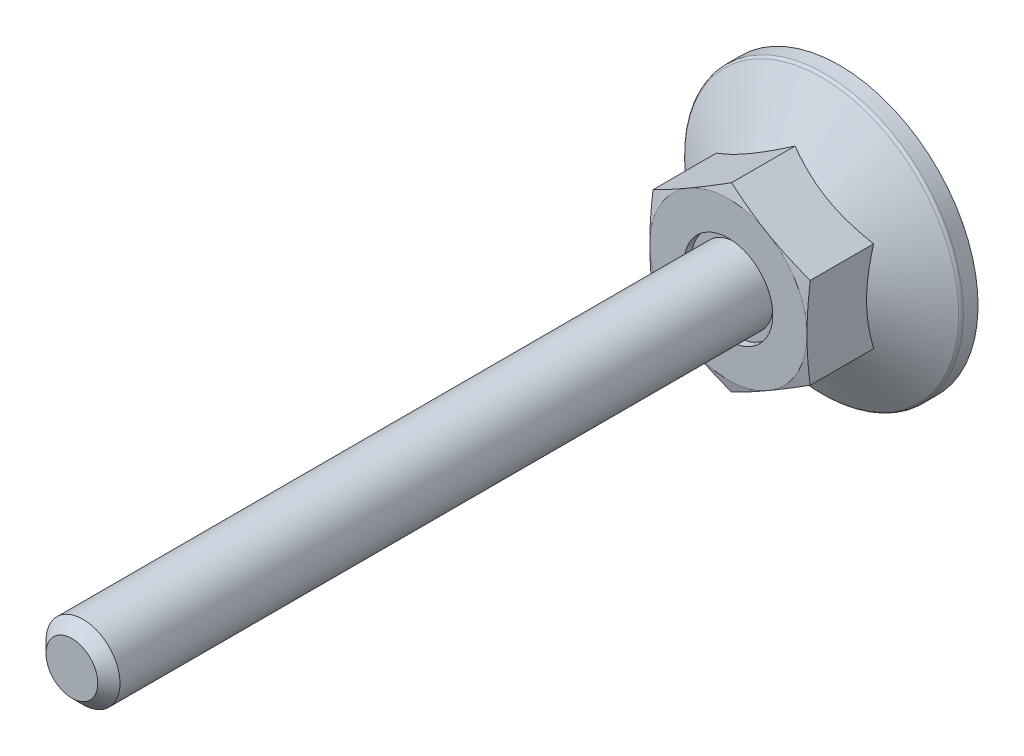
ISO-10303-21;
HEADER;
FILE_DESCRIPTION(('STEP AP214'),'2;1');
FILE_NAME('part.step','',(''),(''),'','','');
FILE_SCHEMA(('AUTOMOTIVE_DESIGN { 1 0 10303 214 1 1 1 1 }'));
ENDSEC;
DATA;
#1=APPLICATION_CONTEXT('core data for automotive mechanical design processes');
#2=APPLICATION_PROTOCOL_DEFINITION('international standard','automotive_design',2000,#1);
#3=PRODUCT_CONTEXT('',#1,'mechanical');
#4=PRODUCT('Part','Part','',(#3));
#5=PRODUCT_RELATED_PRODUCT_CATEGORY('part','',(#4));
#6=PRODUCT_DEFINITION_FORMATION('','',#4);
#7=PRODUCT_DEFINITION_CONTEXT('part definition',#1,'design');
#8=PRODUCT_DEFINITION('design','',#6,#7);
#9=PRODUCT_DEFINITION_SHAPE('','',#8);
#10=(LENGTH_UNIT() NAMED_UNIT(*) SI_UNIT(.MILLI.,.METRE.));
#11=(NAMED_UNIT(*) PLANE_ANGLE_UNIT() SI_UNIT($,.RADIAN.));
#12=(NAMED_UNIT(*) SI_UNIT($,.STERADIAN.) SOLID_ANGLE_UNIT());
#13=UNCERTAINTY_MEASURE_WITH_UNIT(LENGTH_MEASURE(1.E-05),#10,'distance_accuracy_value','');
#14=(GEOMETRIC_REPRESENTATION_CONTEXT(3) GLOBAL_UNCERTAINTY_ASSIGNED_CONTEXT((#13)) GLOBAL_UNIT_ASSIGNED_CONTEXT((#10,
#11,#12)) REPRESENTATION_CONTEXT('',''));
#15=CARTESIAN_POINT('',(0.,0.,0.));
#16=DIRECTION('',(0.,0.,1.));
#17=DIRECTION('',(1.,0.,0.));
#18=AXIS2_PLACEMENT_3D('',#15,#16,#17);
#19=CARTESIAN_POINT('',(0.,0.,11.2));
#20=DIRECTION('',(0.,0.,-1.));
#21=DIRECTION('',(0.,1.,0.));
#22=AXIS2_PLACEMENT_3D('',#19,#20,#21);
#23=PLANE('',#22);
#24=CARTESIAN_POINT('',(0.,0.,11.2));
#25=DIRECTION('',(0.,0.,-1.));
#26=DIRECTION('',(0.,1.,0.));
#27=AXIS2_PLACEMENT_3D('',#24,#25,#26);
#28=CIRCLE('',#27,4.8);
#29=CARTESIAN_POINT('',(0.,4.8,11.2));
#30=VERTEX_POINT('',#29);
#31=EDGE_CURVE('E108',#30,#30,#28,.T.);
#32=ORIENTED_EDGE('',*,*,#31,.F.);
#33=EDGE_LOOP('',(#32));
#34=FACE_BOUND('',#33,.T.);
#35=CARTESIAN_POINT('',(0.,0.,11.2));
#36=DIRECTION('',(0.,0.,-1.));
#37=DIRECTION('',(0.,1.,0.));
#38=AXIS2_PLACEMENT_3D('',#35,#36,#37);
#39=CIRCLE('',#38,4.);
#40=CARTESIAN_POINT('',(0.,4.,11.2));
#41=VERTEX_POINT('',#40);
#42=EDGE_CURVE('E259',#41,#41,#39,.F.);
#43=ORIENTED_EDGE('',*,*,#42,.F.);
#44=EDGE_LOOP('',(#43));
#45=FACE_BOUND('',#44,.T.);
#46=ADVANCED_FACE('F14',(#34,#45),#23,.F.);
#47=CARTESIAN_POINT('',(0.,9.81495457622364,32.));
#48=DIRECTION('',(0.5,-0.866025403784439,0.));
#49=DIRECTION('',(0.866025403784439,0.5,0.));
#50=AXIS2_PLACEMENT_3D('',#47,#48,#49);
#51=PLANE('',#50);
#52=CARTESIAN_POINT('',(-8.5002,4.90736181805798,4.7935207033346));
#53=CARTESIAN_POINT('',(-8.31336077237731,5.01523349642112,4.85579061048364));
#54=CARTESIAN_POINT('',(-8.1258249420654,5.1235073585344,4.91523445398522));
#55=CARTESIAN_POINT('',(-7.74923024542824,5.34093440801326,5.02769163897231));
#56=CARTESIAN_POINT('',(-7.56017075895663,5.45008795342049,5.08070220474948));
#57=CARTESIAN_POINT('',(-6.9899652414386,5.77929626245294,5.22904336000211));
#58=CARTESIAN_POINT('',(-6.60656835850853,6.00065055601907,5.31341782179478));
#59=CARTESIAN_POINT('',(-6.03282233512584,6.33190297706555,5.41235673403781));
#60=CARTESIAN_POINT('',(-5.84418723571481,6.44081150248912,5.44054155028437));
#61=CARTESIAN_POINT('',(-5.46606397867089,6.65912106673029,5.48780266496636));
#62=CARTESIAN_POINT('',(-5.27657589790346,6.76852206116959,5.5068797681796));
#63=CARTESIAN_POINT('',(-4.8972734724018,6.98751241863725,5.53544197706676));
#64=CARTESIAN_POINT('',(-4.70745974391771,7.09710142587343,5.54493796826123));
#65=CARTESIAN_POINT('',(-4.32765694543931,7.3163806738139,5.55413437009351));
#66=CARTESIAN_POINT('',(-4.13766788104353,7.42607091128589,5.55383508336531));
#67=CARTESIAN_POINT('',(-3.78247698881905,7.63114046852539,5.54412227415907));
#68=CARTESIAN_POINT('',(-3.6172500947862,7.72653426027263,5.53589358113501));
#69=CARTESIAN_POINT('',(-3.28718328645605,7.9170984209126,5.51218750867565));
#70=CARTESIAN_POINT('',(-3.12234339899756,8.01226877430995,5.49670964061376));
#71=CARTESIAN_POINT('',(-2.62846189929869,8.29741139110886,5.43976812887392));
#72=CARTESIAN_POINT('',(-2.30029449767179,8.48687892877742,5.38780368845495));
#73=CARTESIAN_POINT('',(-1.64047857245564,8.86782383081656,5.25789180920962));
#74=CARTESIAN_POINT('',(-1.30891425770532,9.05925257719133,5.17939367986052));
#75=CARTESIAN_POINT('',(-0.650730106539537,9.43925537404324,5.00123540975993));
#76=CARTESIAN_POINT('',(-0.32410184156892,9.62783429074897,4.90161711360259));
#77=CARTESIAN_POINT('',(0.000200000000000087,9.81507004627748,4.7935207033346));
#78=B_SPLINE_CURVE_WITH_KNOTS('',3,(#52,#53,#54,#55,#56,#57,#58,#59,#60,#61,#62,#63,#64,#65,#66,
#67,#68,#69,#70,#71,#72,#73,#74,#75,#76,#77),.UNSPECIFIED.,.F.,.F.,(4,2,2,2,2,2,2,2,2,2,2,2,4),
(0.,0.673596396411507,1.34748239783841,2.69805431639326,3.356799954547,4.01548737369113,
4.67342558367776,5.33134346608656,5.90409556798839,6.47688628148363,7.62328361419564,
8.79510569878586,9.9646274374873),.UNSPECIFIED.);
#79=CARTESIAN_POINT('',(-8.5,4.90747728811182,4.79358737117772));
#80=VERTEX_POINT('',#79);
#81=CARTESIAN_POINT('',(0.,9.81495457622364,4.79358737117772));
#82=VERTEX_POINT('',#81);
#83=EDGE_CURVE('E97',#80,#82,#78,.T.);
#84=ORIENTED_EDGE('',*,*,#83,.F.);
#85=DIRECTION('',(0.,0.,-1.));
#86=VECTOR('',#85,1.);
#87=CARTESIAN_POINT('',(-8.5,4.90747728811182,32.));
#88=LINE('',#87,#86);
#89=CARTESIAN_POINT('',(-8.5,4.90747728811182,11.6476589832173));
#90=VERTEX_POINT('',#89);
#91=EDGE_CURVE('E86',#90,#80,#88,.T.);
#92=ORIENTED_EDGE('',*,*,#91,.F.);
#93=CARTESIAN_POINT('',(0.000200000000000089,9.81507004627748,11.6476280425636));
#94=CARTESIAN_POINT('',(-0.352800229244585,9.61126526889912,11.7022599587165));
#95=CARTESIAN_POINT('',(-0.706440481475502,9.40709097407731,11.7518566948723));
#96=CARTESIAN_POINT('',(-1.41496987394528,8.99802133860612,11.8389934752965));
#97=CARTESIAN_POINT('',(-1.76985946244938,8.79312573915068,11.8765286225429));
#98=CARTESIAN_POINT('',(-2.47873586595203,8.38385575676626,11.9373509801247));
#99=CARTESIAN_POINT('',(-2.83271788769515,8.17948414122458,11.9607107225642));
#100=CARTESIAN_POINT('',(-3.5411333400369,7.77048028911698,11.9920337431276));
#101=CARTESIAN_POINT('',(-3.89556667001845,7.56584811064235,12.));
#102=CARTESIAN_POINT('',(-4.60443332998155,7.15658375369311,12.));
#103=CARTESIAN_POINT('',(-4.9588666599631,6.95195157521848,11.9920337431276));
#104=CARTESIAN_POINT('',(-5.66728211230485,6.54294772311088,11.9607107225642));
#105=CARTESIAN_POINT('',(-6.02126413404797,6.33857610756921,11.9373509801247));
#106=CARTESIAN_POINT('',(-6.73014053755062,5.92930612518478,11.8765286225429));
#107=CARTESIAN_POINT('',(-7.08503012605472,5.72441052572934,11.8389934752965));
#108=CARTESIAN_POINT('',(-7.7935595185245,5.31534089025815,11.7518566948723));
#109=CARTESIAN_POINT('',(-8.14719977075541,5.11116659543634,11.7022599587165));
#110=CARTESIAN_POINT('',(-8.5002,4.90736181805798,11.6476280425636));
#111=B_SPLINE_CURVE_WITH_KNOTS('',3,(#93,#94,#95,#96,#97,#98,#99,#100,#101,#102,#103,#104,#105,
#106,#107,#108,#109,#110),.UNSPECIFIED.,.F.,.F.,(4,2,2,2,2,2,2,2,4),(0.,1.23382789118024,
2.46815608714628,3.69611406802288,4.92383440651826,6.15155474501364,7.37951272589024,
8.61384092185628,9.84766881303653),.UNSPECIFIED.);
#112=CARTESIAN_POINT('',(-4.25,7.36121593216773,12.));
#113=VERTEX_POINT('',#112);
#114=EDGE_CURVE('E186',#113,#90,#111,.T.);
#115=ORIENTED_EDGE('',*,*,#114,.F.);
#116=CARTESIAN_POINT('',(0.,9.81495457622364,11.6476589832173));
#117=VERTEX_POINT('',#116);
#118=EDGE_CURVE('E318',#117,#113,#111,.T.);
#119=ORIENTED_EDGE('',*,*,#118,.F.);
#120=DIRECTION('',(0.,0.,-1.));
#121=VECTOR('',#120,1.);
#122=CARTESIAN_POINT('',(0.,9.81495457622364,32.));
#123=LINE('',#122,#121);
#124=EDGE_CURVE('E101',#117,#82,#123,.T.);
#125=ORIENTED_EDGE('',*,*,#124,.T.);
#126=EDGE_LOOP('',(#84,#92,#115,#119,#125));
#127=FACE_BOUND('',#126,.T.);
#128=ADVANCED_FACE('F100',(#127),#51,.F.);
#129=CARTESIAN_POINT('',(8.5,4.90747728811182,32.));
#130=DIRECTION('',(-0.5,-0.866025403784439,0.));
#131=DIRECTION('',(0.866025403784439,-0.5,0.));
#132=AXIS2_PLACEMENT_3D('',#129,#130,#131);
#133=PLANE('',#132);
#134=CARTESIAN_POINT('',(-0.0002,9.81507004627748,4.7935207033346));
#135=CARTESIAN_POINT('',(0.186639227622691,9.70719836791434,4.85579061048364));
#136=CARTESIAN_POINT('',(0.374175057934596,9.59892450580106,4.91523445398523));
#137=CARTESIAN_POINT('',(0.750769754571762,9.3814974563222,5.02769163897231));
#138=CARTESIAN_POINT('',(0.939829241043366,9.27234391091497,5.08070220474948));
#139=CARTESIAN_POINT('',(1.5100347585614,8.94313560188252,5.22904336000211));
#140=CARTESIAN_POINT('',(1.89343164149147,8.72178130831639,5.31341782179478));
#141=CARTESIAN_POINT('',(2.46717766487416,8.39052888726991,5.41235673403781));
#142=CARTESIAN_POINT('',(2.65581276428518,8.28162036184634,5.44054155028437));
#143=CARTESIAN_POINT('',(3.03393602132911,8.06331079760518,5.48780266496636));
#144=CARTESIAN_POINT('',(3.22342410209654,7.95390980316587,5.5068797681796));
#145=CARTESIAN_POINT('',(3.6027265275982,7.73491944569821,5.53544197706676));
#146=CARTESIAN_POINT('',(3.79254025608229,7.62533043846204,5.54493796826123));
#147=CARTESIAN_POINT('',(4.17234305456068,7.40605119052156,5.55413437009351));
#148=CARTESIAN_POINT('',(4.36233211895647,7.29636095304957,5.55383508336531));
#149=CARTESIAN_POINT('',(4.71752301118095,7.09129139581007,5.54412227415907));
#150=CARTESIAN_POINT('',(4.8827499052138,6.99589760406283,5.53589358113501));
#151=CARTESIAN_POINT('',(5.21281671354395,6.80533344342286,5.51218750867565));
#152=CARTESIAN_POINT('',(5.37765660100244,6.71016309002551,5.49670964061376));
#153=CARTESIAN_POINT('',(5.87153810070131,6.42502047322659,5.43976812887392));
#154=CARTESIAN_POINT('',(6.19970550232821,6.23555293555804,5.38780368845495));
#155=CARTESIAN_POINT('',(6.85952142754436,5.8546080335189,5.25789180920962));
#156=CARTESIAN_POINT('',(7.19108574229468,5.66317928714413,5.17939367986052));
#157=CARTESIAN_POINT('',(7.84926989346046,5.28317649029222,5.00123540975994));
#158=CARTESIAN_POINT('',(8.17589815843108,5.09459757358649,4.90161711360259));
#159=CARTESIAN_POINT('',(8.5002,4.90736181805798,4.7935207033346));
#160=B_SPLINE_CURVE_WITH_KNOTS('',3,(#134,#135,#136,#137,#138,#139,#140,#141,#142,#143,#144,
#145,#146,#147,#148,#149,#150,#151,#152,#153,#154,#155,#156,#157,#158,#159),.UNSPECIFIED.,.F.,
.F.,(4,2,2,2,2,2,2,2,2,2,2,2,4),(0.,0.673596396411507,1.34748239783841,2.69805431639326,
3.356799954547,4.01548737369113,4.67342558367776,5.33134346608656,5.90409556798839,
6.47688628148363,7.62328361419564,8.79510569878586,9.9646274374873),.UNSPECIFIED.);
#161=CARTESIAN_POINT('',(8.5,4.90747728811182,4.79358737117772));
#162=VERTEX_POINT('',#161);
#163=EDGE_CURVE('E29',#82,#162,#160,.T.);
#164=ORIENTED_EDGE('',*,*,#163,.F.);
#165=ORIENTED_EDGE('',*,*,#124,.F.);
#166=CARTESIAN_POINT('',(8.5002,4.90736181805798,11.6476280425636));
#167=CARTESIAN_POINT('',(8.14719977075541,5.11116659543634,11.7022599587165));
#168=CARTESIAN_POINT('',(7.7935595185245,5.31534089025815,11.7518566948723));
#169=CARTESIAN_POINT('',(7.08503012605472,5.72441052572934,11.8389934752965));
#170=CARTESIAN_POINT('',(6.73014053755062,5.92930612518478,11.8765286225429));
#171=CARTESIAN_POINT('',(6.02126413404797,6.33857610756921,11.9373509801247));
#172=CARTESIAN_POINT('',(5.66728211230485,6.54294772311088,11.9607107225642));
#173=CARTESIAN_POINT('',(4.9588666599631,6.95195157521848,11.9920337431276));
#174=CARTESIAN_POINT('',(4.60443332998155,7.15658375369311,12.));
#175=CARTESIAN_POINT('',(3.89556667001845,7.56584811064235,12.));
#176=CARTESIAN_POINT('',(3.5411333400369,7.77048028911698,11.9920337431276));
#177=CARTESIAN_POINT('',(2.83271788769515,8.17948414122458,11.9607107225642));
#178=CARTESIAN_POINT('',(2.47873586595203,8.38385575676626,11.9373509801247));
#179=CARTESIAN_POINT('',(1.76985946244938,8.79312573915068,11.8765286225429));
#180=CARTESIAN_POINT('',(1.41496987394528,8.99802133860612,11.8389934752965));
#181=CARTESIAN_POINT('',(0.706440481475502,9.40709097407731,11.7518566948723));
#182=CARTESIAN_POINT('',(0.352800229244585,9.61126526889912,11.7022599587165));
#183=CARTESIAN_POINT('',(-0.000200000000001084,9.81507004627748,11.6476280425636));
#184=B_SPLINE_CURVE_WITH_KNOTS('',3,(#166,#167,#168,#169,#170,#171,#172,#173,#174,#175,#176,
#177,#178,#179,#180,#181,#182,#183),.UNSPECIFIED.,.F.,.F.,(4,2,2,2,2,2,2,2,4),(0.,
1.23382789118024,2.46815608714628,3.69611406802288,4.92383440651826,6.15155474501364,
7.37951272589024,8.61384092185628,9.84766881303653),.UNSPECIFIED.);
#185=CARTESIAN_POINT('',(4.25,7.36121593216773,12.));
#186=VERTEX_POINT('',#185);
#187=EDGE_CURVE('E177',#186,#117,#184,.T.);
#188=ORIENTED_EDGE('',*,*,#187,.F.);
#189=CARTESIAN_POINT('',(8.5,4.90747728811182,11.6476589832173));
#190=VERTEX_POINT('',#189);
#191=EDGE_CURVE('E184',#190,#186,#184,.T.);
#192=ORIENTED_EDGE('',*,*,#191,.F.);
#193=DIRECTION('',(0.,0.,-1.));
#194=VECTOR('',#193,1.);
#195=CARTESIAN_POINT('',(8.5,4.90747728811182,32.));
#196=LINE('',#195,#194);
#197=EDGE_CURVE('E216',#190,#162,#196,.T.);
#198=ORIENTED_EDGE('',*,*,#197,.T.);
#199=EDGE_LOOP('',(#164,#165,#188,#192,#198));
#200=FACE_BOUND('',#199,.T.);
#201=ADVANCED_FACE('F192',(#200),#133,.F.);
#202=CARTESIAN_POINT('',(8.5,-4.90747728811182,32.));
#203=DIRECTION('',(-1.,0.,0.));
#204=DIRECTION('',(0.,-1.,0.));
#205=AXIS2_PLACEMENT_3D('',#202,#203,#204);
#206=PLANE('',#205);
#207=CARTESIAN_POINT('',(8.5,13.0314294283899,1.47752704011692));
#208=CARTESIAN_POINT('',(8.5,12.6612665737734,1.65647774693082));
#209=CARTESIAN_POINT('',(8.5,12.290237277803,1.83366776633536));
#210=CARTESIAN_POINT('',(8.5,11.5459841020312,2.1835324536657));
#211=CARTESIAN_POINT('',(8.5,11.1727598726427,2.3562063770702));
#212=CARTESIAN_POINT('',(8.5,10.4216603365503,2.69694543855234));
#213=CARTESIAN_POINT('',(8.5,10.0437706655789,2.86497902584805));
#214=CARTESIAN_POINT('',(8.5,9.2849306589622,3.19396010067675));
#215=CARTESIAN_POINT('',(8.5,8.90398047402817,3.35490793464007));
#216=CARTESIAN_POINT('',(8.5,8.12702308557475,3.67249615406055));
#217=CARTESIAN_POINT('',(8.5,7.73090483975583,3.82886642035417));
#218=CARTESIAN_POINT('',(8.5,6.93398073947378,4.12940330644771));
#219=CARTESIAN_POINT('',(8.5,6.53317435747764,4.27356853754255));
#220=CARTESIAN_POINT('',(8.5,5.72703031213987,4.54580160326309));
#221=CARTESIAN_POINT('',(8.5,5.32170421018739,4.67390329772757));
#222=CARTESIAN_POINT('',(8.5,4.50525785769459,4.90980359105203));
#223=CARTESIAN_POINT('',(8.5,4.09413952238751,5.01760873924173));
#224=CARTESIAN_POINT('',(8.5,3.26789885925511,5.20711197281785));
#225=CARTESIAN_POINT('',(8.5,2.85280627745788,5.28893618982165));
#226=CARTESIAN_POINT('',(8.5,2.22651264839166,5.38853539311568));
#227=CARTESIAN_POINT('',(8.5,2.01712321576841,5.41788026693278));
#228=CARTESIAN_POINT('',(8.5,1.59735566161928,5.46827917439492));
#229=CARTESIAN_POINT('',(8.5,1.38697763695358,5.48933400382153));
#230=CARTESIAN_POINT('',(8.5,0.968196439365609,5.52247691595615));
#231=CARTESIAN_POINT('',(8.5,0.759802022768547,5.53467524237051));
#232=CARTESIAN_POINT('',(8.5,0.342684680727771,5.55026003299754));
#233=CARTESIAN_POINT('',(8.5,0.133961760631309,5.5536466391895));
#234=CARTESIAN_POINT('',(8.5,-0.283445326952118,5.55152742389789));
#235=CARTESIAN_POINT('',(8.5,-0.492129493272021,5.546021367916));
#236=CARTESIAN_POINT('',(8.5,-0.909085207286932,5.52624824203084));
#237=CARTESIAN_POINT('',(8.5,-1.11735673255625,5.51198070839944));
#238=CARTESIAN_POINT('',(8.5,-1.62231800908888,5.46706351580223));
#239=CARTESIAN_POINT('',(8.5,-1.91862399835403,5.43201243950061));
#240=CARTESIAN_POINT('',(8.5,-2.50892471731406,5.34612267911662));
#241=CARTESIAN_POINT('',(8.5,-2.80291910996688,5.29528173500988));
#242=CARTESIAN_POINT('',(8.5,-3.68114216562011,5.12178025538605));
#243=CARTESIAN_POINT('',(8.5,-4.26128126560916,4.97817413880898));
#244=CARTESIAN_POINT('',(8.5,-5.12903133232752,4.73045572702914));
#245=CARTESIAN_POINT('',(8.5,-5.42116721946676,4.64129591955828));
#246=CARTESIAN_POINT('',(8.5,-6.0025970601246,4.45406394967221));
#247=CARTESIAN_POINT('',(8.5,-6.29189099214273,4.35599171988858));
#248=CARTESIAN_POINT('',(8.5,-6.86774141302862,4.15248019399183));
#249=CARTESIAN_POINT('',(8.5,-7.15429879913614,4.0470434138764));
#250=CARTESIAN_POINT('',(8.5,-7.72505625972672,3.83000899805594));
#251=CARTESIAN_POINT('',(8.5,-8.00925638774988,3.71841150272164));
#252=CARTESIAN_POINT('',(8.5,-8.7865968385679,3.40502511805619));
#253=CARTESIAN_POINT('',(8.5,-9.2776226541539,3.197996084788));
#254=CARTESIAN_POINT('',(8.5,-10.2546964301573,2.77246752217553));
#255=CARTESIAN_POINT('',(8.5,-10.7407438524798,2.55396676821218));
#256=CARTESIAN_POINT('',(8.5,-11.7090438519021,2.108282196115));
#257=CARTESIAN_POINT('',(8.5,-12.1912949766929,1.88109523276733));
#258=CARTESIAN_POINT('',(8.5,-13.1526185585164,1.42016244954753));
#259=CARTESIAN_POINT('',(8.5,-13.6316911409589,1.18641689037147));
#260=CARTESIAN_POINT('',(8.5,-14.588034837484,0.713462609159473));
#261=CARTESIAN_POINT('',(8.5,-15.0653020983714,0.47424611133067));
#262=CARTESIAN_POINT('',(8.5,-16.0177905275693,-0.00822936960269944));
#263=CARTESIAN_POINT('',(8.5,-16.4930116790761,-0.251488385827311));
#264=CARTESIAN_POINT('',(8.5,-17.4416812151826,-0.741191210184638));
#265=CARTESIAN_POINT('',(8.5,-17.9151299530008,-0.987634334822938));
#266=CARTESIAN_POINT('',(8.5,-18.8606492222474,-1.48315179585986));
#267=CARTESIAN_POINT('',(8.5,-19.3327197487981,-1.73222614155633));
#268=CARTESIAN_POINT('',(8.5,-20.6461392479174,-2.42904815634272));
#269=CARTESIAN_POINT('',(8.5,-21.4862394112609,-2.87914918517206));
#270=CARTESIAN_POINT('',(8.5,-23.1638169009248,-3.78432075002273));
#271=CARTESIAN_POINT('',(8.5,-24.0012940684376,-4.23939157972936));
#272=CARTESIAN_POINT('',(8.5,-25.671623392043,-5.15180725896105));
#273=CARTESIAN_POINT('',(8.5,-26.5044818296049,-5.60914061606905));
#274=CARTESIAN_POINT('',(8.5,-27.7525740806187,-6.29723391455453));
#275=CARTESIAN_POINT('',(8.5,-28.1683903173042,-6.52693873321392));
#276=CARTESIAN_POINT('',(8.5,-28.9996764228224,-6.98697325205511));
#277=CARTESIAN_POINT('',(8.5,-29.4151462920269,-7.21730295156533));
#278=CARTESIAN_POINT('',(8.5,-29.8304643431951,-7.44790614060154));
#279=B_SPLINE_CURVE_WITH_KNOTS('',3,(#207,#208,#209,#210,#211,#212,#213,#214,#215,#216,#217,
#218,#219,#220,#221,#222,#223,#224,#225,#226,#227,#228,#229,#230,#231,#232,#233,#234,#235,#236,
#237,#238,#239,#240,#241,#242,#243,#244,#245,#246,#247,#248,#249,#250,#251,#252,#253,#254,#255,
#256,#257,#258,#259,#260,#261,#262,#263,#264,#265,#266,#267,#268,#269,#270,#271,#272,#273,#274,
#275,#276,#277,#278),.UNSPECIFIED.,.F.,.F.,(4,2,2,2,2,2,2,2,2,2,2,2,2,2,2,2,2,2,2,2,2,2,2,2,2,2,
2,2,2,2,2,2,2,2,2,4),(0.,1.23346428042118,2.46713064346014,3.70776702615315,4.94834268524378,
6.22578289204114,7.5033682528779,8.77821366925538,10.0526470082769,11.32079515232,
11.9549638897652,12.5890717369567,13.2151443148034,13.8412068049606,14.4672858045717,
15.0933979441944,15.9880059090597,16.8827419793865,18.6732029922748,19.5894472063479,
20.5056983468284,21.4216379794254,22.3375567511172,23.9359919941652,25.5345982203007,
27.1337888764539,28.7329160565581,30.3344778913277,31.9360528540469,33.5372895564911,
35.1385319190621,37.9977422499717,40.8571224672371,43.7075995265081,45.1327331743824,
46.5578652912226),.UNSPECIFIED.);
#280=CARTESIAN_POINT('',(8.5,-4.90747728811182,4.79358737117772));
#281=VERTEX_POINT('',#280);
#282=EDGE_CURVE('E37',#162,#281,#279,.T.);
#283=ORIENTED_EDGE('',*,*,#282,.F.);
#284=ORIENTED_EDGE('',*,*,#197,.F.);
#285=CARTESIAN_POINT('',(8.5,12.9820891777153,10.1197370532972));
#286=CARTESIAN_POINT('',(8.5,12.5964686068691,10.2061594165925));
#287=CARTESIAN_POINT('',(8.5,12.2106068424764,10.2915248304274));
#288=CARTESIAN_POINT('',(8.5,11.4382824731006,10.4595712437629));
#289=CARTESIAN_POINT('',(8.5,11.0518198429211,10.5422521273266));
#290=CARTESIAN_POINT('',(8.5,10.2778290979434,10.7044309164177));
#291=CARTESIAN_POINT('',(8.5,9.89030030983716,10.7839256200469));
#292=CARTESIAN_POINT('',(8.5,9.11443612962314,10.9388739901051));
#293=CARTESIAN_POINT('',(8.5,8.72610074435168,11.0143276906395));
#294=CARTESIAN_POINT('',(8.5,7.95158013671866,11.159650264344));
#295=CARTESIAN_POINT('',(8.5,7.56540239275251,11.2295587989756));
#296=CARTESIAN_POINT('',(8.5,6.79199352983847,11.3632725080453));
#297=CARTESIAN_POINT('',(8.5,6.40476243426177,11.4270778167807));
#298=CARTESIAN_POINT('',(8.5,5.62917169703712,11.54714843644));
#299=CARTESIAN_POINT('',(8.5,5.24081220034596,11.6034146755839));
#300=CARTESIAN_POINT('',(8.5,4.46285737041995,11.70674908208));
#301=CARTESIAN_POINT('',(8.5,4.07326203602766,11.7538172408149));
#302=CARTESIAN_POINT('',(8.5,3.28844017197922,11.8374226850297));
#303=CARTESIAN_POINT('',(8.5,2.89320002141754,11.8738340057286));
#304=CARTESIAN_POINT('',(8.5,2.10172608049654,11.9336139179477));
#305=CARTESIAN_POINT('',(8.5,1.70549231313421,11.9569828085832));
#306=CARTESIAN_POINT('',(8.5,0.91260591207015,11.9893148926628));
#307=CARTESIAN_POINT('',(8.5,0.515953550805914,11.9982846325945));
#308=CARTESIAN_POINT('',(8.5,-0.277408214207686,12.0012669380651));
#309=CARTESIAN_POINT('',(8.5,-0.674117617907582,11.9952795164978));
#310=CARTESIAN_POINT('',(8.5,-1.46847963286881,11.9686842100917));
#311=CARTESIAN_POINT('',(8.5,-1.86613043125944,11.9480232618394));
#312=CARTESIAN_POINT('',(8.5,-2.66049684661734,11.8932602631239));
#313=CARTESIAN_POINT('',(8.5,-3.05721244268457,11.8591579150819));
#314=CARTESIAN_POINT('',(8.5,-3.84970511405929,11.7792347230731));
#315=CARTESIAN_POINT('',(8.5,-4.24548140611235,11.7334062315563));
#316=CARTESIAN_POINT('',(8.5,-5.03576028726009,11.6319377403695));
#317=CARTESIAN_POINT('',(8.5,-5.43026287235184,11.5762977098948));
#318=CARTESIAN_POINT('',(8.5,-6.19195385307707,11.4609360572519));
#319=CARTESIAN_POINT('',(8.5,-6.55922094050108,11.4017287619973));
#320=CARTESIAN_POINT('',(8.5,-7.29278719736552,11.2775674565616));
#321=CARTESIAN_POINT('',(8.5,-7.65908634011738,11.2126132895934));
#322=CARTESIAN_POINT('',(8.5,-8.39085027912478,11.078008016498));
#323=CARTESIAN_POINT('',(8.5,-8.75631499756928,11.0083564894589));
#324=CARTESIAN_POINT('',(8.5,-9.48649515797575,10.8652200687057));
#325=CARTESIAN_POINT('',(8.5,-9.85121059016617,10.7917351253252));
#326=CARTESIAN_POINT('',(8.5,-10.5800753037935,10.6416087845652));
#327=CARTESIAN_POINT('',(8.5,-10.944224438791,10.5649666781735));
#328=CARTESIAN_POINT('',(8.5,-11.6719684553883,10.4090909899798));
#329=CARTESIAN_POINT('',(8.5,-12.0355633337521,10.3298573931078));
#330=CARTESIAN_POINT('',(8.5,-13.1255915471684,10.0889686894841));
#331=CARTESIAN_POINT('',(8.5,-13.8513178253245,9.92411536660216));
#332=CARTESIAN_POINT('',(8.5,-15.2942598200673,9.59010912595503));
#333=CARTESIAN_POINT('',(8.5,-16.0114890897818,9.42101437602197));
#334=CARTESIAN_POINT('',(8.5,-17.4449475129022,9.07858755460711));
#335=CARTESIAN_POINT('',(8.5,-18.1611766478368,8.90525540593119));
#336=CARTESIAN_POINT('',(8.5,-19.5919856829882,8.5556799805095));
#337=CARTESIAN_POINT('',(8.5,-20.306566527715,8.37944056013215));
#338=CARTESIAN_POINT('',(8.5,-21.7351057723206,8.02455520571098));
#339=CARTESIAN_POINT('',(8.5,-22.4490641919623,7.8459093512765));
#340=CARTESIAN_POINT('',(8.5,-23.1628057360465,7.66641079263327));
#341=B_SPLINE_CURVE_WITH_KNOTS('',3,(#285,#286,#287,#288,#289,#290,#291,#292,#293,#294,#295,
#296,#297,#298,#299,#300,#301,#302,#303,#304,#305,#306,#307,#308,#309,#310,#311,#312,#313,#314,
#315,#316,#317,#318,#319,#320,#321,#322,#323,#324,#325,#326,#327,#328,#329,#330,#331,#332,#333,
#334,#335,#336,#337,#338,#339,#340),.UNSPECIFIED.,.F.,.F.,(4,2,2,2,2,2,2,2,2,2,2,2,2,2,2,2,2,2,
2,2,2,2,2,2,2,2,2,4),(0.,1.18556310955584,2.37117735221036,3.55795462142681,4.74472187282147,
5.92204594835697,7.09934411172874,8.27649719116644,9.45365137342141,10.6442044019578,
11.8347301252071,13.0247144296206,14.2146977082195,15.4090063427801,16.6033414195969,
17.7984574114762,18.9935771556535,20.1095500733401,21.2255534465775,22.3416569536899,
23.4577749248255,24.5741449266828,25.6905214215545,27.9231231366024,30.1337863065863,
32.3444897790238,34.5524651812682,36.7603677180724),.UNSPECIFIED.);
#342=CARTESIAN_POINT('',(8.5,0.,12.));
#343=VERTEX_POINT('',#342);
#344=EDGE_CURVE('E170',#343,#190,#341,.F.);
#345=ORIENTED_EDGE('',*,*,#344,.F.);
#346=CARTESIAN_POINT('',(8.5,-4.90747728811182,11.6476589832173));
#347=VERTEX_POINT('',#346);
#348=EDGE_CURVE('E185',#347,#343,#341,.F.);
#349=ORIENTED_EDGE('',*,*,#348,.F.);
#350=DIRECTION('',(0.,0.,-1.));
#351=VECTOR('',#350,1.);
#352=CARTESIAN_POINT('',(8.5,-4.90747728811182,32.));
#353=LINE('',#352,#351);
#354=EDGE_CURVE('E218',#347,#281,#353,.T.);
#355=ORIENTED_EDGE('',*,*,#354,.T.);
#356=EDGE_LOOP('',(#283,#284,#345,#349,#355));
#357=FACE_BOUND('',#356,.T.);
#358=ADVANCED_FACE('F195',(#357),#206,.F.);
#359=CARTESIAN_POINT('',(0.,-9.81495457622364,32.));
#360=DIRECTION('',(-0.5,0.866025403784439,0.));
#361=DIRECTION('',(-0.866025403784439,-0.5,0.));
#362=AXIS2_PLACEMENT_3D('',#359,#360,#361);
#363=PLANE('',#362);
#364=CARTESIAN_POINT('',(8.5002,-4.90736181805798,4.7935207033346));
#365=CARTESIAN_POINT('',(8.31336077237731,-5.01523349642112,4.85579061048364));
#366=CARTESIAN_POINT('',(8.1258249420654,-5.1235073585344,4.91523445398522));
#367=CARTESIAN_POINT('',(7.74923024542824,-5.34093440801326,5.02769163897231));
#368=CARTESIAN_POINT('',(7.56017075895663,-5.45008795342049,5.08070220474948));
#369=CARTESIAN_POINT('',(6.9899652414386,-5.77929626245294,5.22904336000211));
#370=CARTESIAN_POINT('',(6.60656835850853,-6.00065055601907,5.31341782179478));
#371=CARTESIAN_POINT('',(6.03282233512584,-6.33190297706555,5.41235673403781));
#372=CARTESIAN_POINT('',(5.84418723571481,-6.44081150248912,5.44054155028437));
#373=CARTESIAN_POINT('',(5.46606397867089,-6.65912106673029,5.48780266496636));
#374=CARTESIAN_POINT('',(5.27657589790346,-6.76852206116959,5.5068797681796));
#375=CARTESIAN_POINT('',(4.8972734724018,-6.98751241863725,5.53544197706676));
#376=CARTESIAN_POINT('',(4.70745974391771,-7.09710142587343,5.54493796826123));
#377=CARTESIAN_POINT('',(4.32765694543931,-7.3163806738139,5.55413437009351));
#378=CARTESIAN_POINT('',(4.13766788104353,-7.42607091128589,5.55383508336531));
#379=CARTESIAN_POINT('',(3.78247698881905,-7.63114046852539,5.54412227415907));
#380=CARTESIAN_POINT('',(3.6172500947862,-7.72653426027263,5.53589358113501));
#381=CARTESIAN_POINT('',(3.28718328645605,-7.9170984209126,5.51218750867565));
#382=CARTESIAN_POINT('',(3.12234339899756,-8.01226877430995,5.49670964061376));
#383=CARTESIAN_POINT('',(2.62846189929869,-8.29741139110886,5.43976812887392));
#384=CARTESIAN_POINT('',(2.30029449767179,-8.48687892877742,5.38780368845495));
#385=CARTESIAN_POINT('',(1.64047857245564,-8.86782383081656,5.25789180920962));
#386=CARTESIAN_POINT('',(1.30891425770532,-9.05925257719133,5.17939367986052));
#387=CARTESIAN_POINT('',(0.650730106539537,-9.43925537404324,5.00123540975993));
#388=CARTESIAN_POINT('',(0.32410184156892,-9.62783429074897,4.90161711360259));
#389=CARTESIAN_POINT('',(-0.000200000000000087,-9.81507004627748,4.7935207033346));
#390=B_SPLINE_CURVE_WITH_KNOTS('',3,(#364,#365,#366,#367,#368,#369,#370,#371,#372,#373,#374,
#375,#376,#377,#378,#379,#380,#381,#382,#383,#384,#385,#386,#387,#388,#389),.UNSPECIFIED.,.F.,
.F.,(4,2,2,2,2,2,2,2,2,2,2,2,4),(0.,0.673596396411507,1.34748239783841,2.69805431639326,
3.356799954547,4.01548737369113,4.67342558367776,5.33134346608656,5.90409556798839,
6.47688628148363,7.62328361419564,8.79510569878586,9.9646274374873),.UNSPECIFIED.);
#391=CARTESIAN_POINT('',(0.,-9.81495457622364,4.79358737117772));
#392=VERTEX_POINT('',#391);
#393=EDGE_CURVE('E276',#281,#392,#390,.T.);
#394=ORIENTED_EDGE('',*,*,#393,.F.);
#395=ORIENTED_EDGE('',*,*,#354,.F.);
#396=CARTESIAN_POINT('',(-0.000200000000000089,-9.81507004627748,11.6476280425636));
#397=CARTESIAN_POINT('',(0.352800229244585,-9.61126526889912,11.7022599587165));
#398=CARTESIAN_POINT('',(0.706440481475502,-9.40709097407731,11.7518566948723));
#399=CARTESIAN_POINT('',(1.41496987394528,-8.99802133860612,11.8389934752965));
#400=CARTESIAN_POINT('',(1.76985946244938,-8.79312573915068,11.8765286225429));
#401=CARTESIAN_POINT('',(2.47873586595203,-8.38385575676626,11.9373509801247));
#402=CARTESIAN_POINT('',(2.83271788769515,-8.17948414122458,11.9607107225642));
#403=CARTESIAN_POINT('',(3.5411333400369,-7.77048028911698,11.9920337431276));
#404=CARTESIAN_POINT('',(3.89556667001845,-7.56584811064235,12.));
#405=CARTESIAN_POINT('',(4.60443332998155,-7.15658375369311,12.));
#406=CARTESIAN_POINT('',(4.9588666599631,-6.95195157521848,11.9920337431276));
#407=CARTESIAN_POINT('',(5.66728211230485,-6.54294772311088,11.9607107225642));
#408=CARTESIAN_POINT('',(6.02126413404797,-6.33857610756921,11.9373509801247));
#409=CARTESIAN_POINT('',(6.73014053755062,-5.92930612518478,11.8765286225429));
#410=CARTESIAN_POINT('',(7.08503012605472,-5.72441052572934,11.8389934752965));
#411=CARTESIAN_POINT('',(7.7935595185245,-5.31534089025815,11.7518566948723));
#412=CARTESIAN_POINT('',(8.14719977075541,-5.11116659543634,11.7022599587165));
#413=CARTESIAN_POINT('',(8.5002,-4.90736181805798,11.6476280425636));
#414=B_SPLINE_CURVE_WITH_KNOTS('',3,(#396,#397,#398,#399,#400,#401,#402,#403,#404,#405,#406,
#407,#408,#409,#410,#411,#412,#413),.UNSPECIFIED.,.F.,.F.,(4,2,2,2,2,2,2,2,4),(0.,
1.23382789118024,2.46815608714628,3.69611406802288,4.92383440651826,6.15155474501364,
7.37951272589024,8.61384092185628,9.84766881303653),.UNSPECIFIED.);
#415=CARTESIAN_POINT('',(4.25,-7.36121593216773,12.));
#416=VERTEX_POINT('',#415);
#417=EDGE_CURVE('E164',#416,#347,#414,.T.);
#418=ORIENTED_EDGE('',*,*,#417,.F.);
#419=CARTESIAN_POINT('',(0.,-9.81495457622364,11.6476589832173));
#420=VERTEX_POINT('',#419);
#421=EDGE_CURVE('E299',#420,#416,#414,.T.);
#422=ORIENTED_EDGE('',*,*,#421,.F.);
#423=DIRECTION('',(0.,0.,-1.));
#424=VECTOR('',#423,1.);
#425=CARTESIAN_POINT('',(0.,-9.81495457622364,32.));
#426=LINE('',#425,#424);
#427=EDGE_CURVE('E220',#420,#392,#426,.T.);
#428=ORIENTED_EDGE('',*,*,#427,.T.);
#429=EDGE_LOOP('',(#394,#395,#418,#422,#428));
#430=FACE_BOUND('',#429,.T.);
#431=ADVANCED_FACE('F281',(#430),#363,.F.);
#432=CARTESIAN_POINT('',(-8.5,-4.90747728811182,32.));
#433=DIRECTION('',(0.5,0.866025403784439,0.));
#434=DIRECTION('',(-0.866025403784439,0.5,0.));
#435=AXIS2_PLACEMENT_3D('',#432,#433,#434);
#436=PLANE('',#435);
#437=CARTESIAN_POINT('',(0.0002,-9.81507004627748,4.7935207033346));
#438=CARTESIAN_POINT('',(-0.186639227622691,-9.70719836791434,4.85579061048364));
#439=CARTESIAN_POINT('',(-0.374175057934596,-9.59892450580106,4.91523445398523));
#440=CARTESIAN_POINT('',(-0.750769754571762,-9.3814974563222,5.02769163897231));
#441=CARTESIAN_POINT('',(-0.939829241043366,-9.27234391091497,5.08070220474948));
#442=CARTESIAN_POINT('',(-1.5100347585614,-8.94313560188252,5.22904336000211));
#443=CARTESIAN_POINT('',(-1.89343164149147,-8.72178130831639,5.31341782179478));
#444=CARTESIAN_POINT('',(-2.46717766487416,-8.39052888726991,5.41235673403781));
#445=CARTESIAN_POINT('',(-2.65581276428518,-8.28162036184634,5.44054155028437));
#446=CARTESIAN_POINT('',(-3.03393602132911,-8.06331079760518,5.48780266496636));
#447=CARTESIAN_POINT('',(-3.22342410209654,-7.95390980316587,5.5068797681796));
#448=CARTESIAN_POINT('',(-3.6027265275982,-7.73491944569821,5.53544197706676));
#449=CARTESIAN_POINT('',(-3.79254025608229,-7.62533043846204,5.54493796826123));
#450=CARTESIAN_POINT('',(-4.17234305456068,-7.40605119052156,5.55413437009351));
#451=CARTESIAN_POINT('',(-4.36233211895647,-7.29636095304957,5.55383508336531));
#452=CARTESIAN_POINT('',(-4.71752301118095,-7.09129139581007,5.54412227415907));
#453=CARTESIAN_POINT('',(-4.8827499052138,-6.99589760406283,5.53589358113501));
#454=CARTESIAN_POINT('',(-5.21281671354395,-6.80533344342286,5.51218750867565));
#455=CARTESIAN_POINT('',(-5.37765660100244,-6.71016309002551,5.49670964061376));
#456=CARTESIAN_POINT('',(-5.87153810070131,-6.42502047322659,5.43976812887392));
#457=CARTESIAN_POINT('',(-6.19970550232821,-6.23555293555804,5.38780368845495));
#458=CARTESIAN_POINT('',(-6.85952142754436,-5.8546080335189,5.25789180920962));
#459=CARTESIAN_POINT('',(-7.19108574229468,-5.66317928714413,5.17939367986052));
#460=CARTESIAN_POINT('',(-7.84926989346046,-5.28317649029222,5.00123540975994));
#461=CARTESIAN_POINT('',(-8.17589815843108,-5.09459757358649,4.90161711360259));
#462=CARTESIAN_POINT('',(-8.5002,-4.90736181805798,4.7935207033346));
#463=B_SPLINE_CURVE_WITH_KNOTS('',3,(#437,#438,#439,#440,#441,#442,#443,#444,#445,#446,#447,
#448,#449,#450,#451,#452,#453,#454,#455,#456,#457,#458,#459,#460,#461,#462),.UNSPECIFIED.,.F.,
.F.,(4,2,2,2,2,2,2,2,2,2,2,2,4),(0.,0.673596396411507,1.34748239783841,2.69805431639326,
3.356799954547,4.01548737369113,4.67342558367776,5.33134346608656,5.90409556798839,
6.47688628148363,7.62328361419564,8.79510569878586,9.9646274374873),.UNSPECIFIED.);
#464=CARTESIAN_POINT('',(-8.5,-4.90747728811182,4.79358737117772));
#465=VERTEX_POINT('',#464);
#466=EDGE_CURVE('E107',#392,#465,#463,.T.);
#467=ORIENTED_EDGE('',*,*,#466,.F.);
#468=ORIENTED_EDGE('',*,*,#427,.F.);
#469=CARTESIAN_POINT('',(-8.5002,-4.90736181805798,11.6476280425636));
#470=CARTESIAN_POINT('',(-8.14719977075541,-5.11116659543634,11.7022599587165));
#471=CARTESIAN_POINT('',(-7.7935595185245,-5.31534089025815,11.7518566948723));
#472=CARTESIAN_POINT('',(-7.08503012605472,-5.72441052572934,11.8389934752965));
#473=CARTESIAN_POINT('',(-6.73014053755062,-5.92930612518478,11.8765286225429));
#474=CARTESIAN_POINT('',(-6.02126413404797,-6.33857610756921,11.9373509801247));
#475=CARTESIAN_POINT('',(-5.66728211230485,-6.54294772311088,11.9607107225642));
#476=CARTESIAN_POINT('',(-4.9588666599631,-6.95195157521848,11.9920337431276));
#477=CARTESIAN_POINT('',(-4.60443332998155,-7.15658375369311,12.));
#478=CARTESIAN_POINT('',(-3.89556667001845,-7.56584811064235,12.));
#479=CARTESIAN_POINT('',(-3.5411333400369,-7.77048028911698,11.9920337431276));
#480=CARTESIAN_POINT('',(-2.83271788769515,-8.17948414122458,11.9607107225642));
#481=CARTESIAN_POINT('',(-2.47873586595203,-8.38385575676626,11.9373509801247));
#482=CARTESIAN_POINT('',(-1.76985946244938,-8.79312573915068,11.8765286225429));
#483=CARTESIAN_POINT('',(-1.41496987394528,-8.99802133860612,11.8389934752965));
#484=CARTESIAN_POINT('',(-0.706440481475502,-9.40709097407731,11.7518566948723));
#485=CARTESIAN_POINT('',(-0.352800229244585,-9.61126526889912,11.7022599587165));
#486=CARTESIAN_POINT('',(0.000200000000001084,-9.81507004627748,11.6476280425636));
#487=B_SPLINE_CURVE_WITH_KNOTS('',3,(#469,#470,#471,#472,#473,#474,#475,#476,#477,#478,#479,
#480,#481,#482,#483,#484,#485,#486),.UNSPECIFIED.,.F.,.F.,(4,2,2,2,2,2,2,2,4),(0.,
1.23382789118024,2.46815608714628,3.69611406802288,4.92383440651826,6.15155474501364,
7.37951272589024,8.61384092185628,9.84766881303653),.UNSPECIFIED.);
#488=CARTESIAN_POINT('',(-4.25,-7.36121593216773,12.));
#489=VERTEX_POINT('',#488);
#490=EDGE_CURVE('E144',#489,#420,#487,.T.);
#491=ORIENTED_EDGE('',*,*,#490,.F.);
#492=CARTESIAN_POINT('',(-8.5,-4.90747728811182,11.6476589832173));
#493=VERTEX_POINT('',#492);
#494=EDGE_CURVE('E226',#493,#489,#487,.T.);
#495=ORIENTED_EDGE('',*,*,#494,.F.);
#496=DIRECTION('',(0.,0.,-1.));
#497=VECTOR('',#496,1.);
#498=CARTESIAN_POINT('',(-8.5,-4.90747728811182,32.));
#499=LINE('',#498,#497);
#500=EDGE_CURVE('E96',#493,#465,#499,.T.);
#501=ORIENTED_EDGE('',*,*,#500,.T.);
#502=EDGE_LOOP('',(#467,#468,#491,#495,#501));
#503=FACE_BOUND('',#502,.T.);
#504=ADVANCED_FACE('F129',(#503),#436,.F.);
#505=CARTESIAN_POINT('',(-8.5,4.90747728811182,32.));
#506=DIRECTION('',(1.,0.,0.));
#507=DIRECTION('',(0.,1.,0.));
#508=AXIS2_PLACEMENT_3D('',#505,#506,#507);
#509=PLANE('',#508);
#510=CARTESIAN_POINT('',(-8.5,13.0314294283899,1.47752704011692));
#511=CARTESIAN_POINT('',(-8.5,12.6612665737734,1.65647774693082));
#512=CARTESIAN_POINT('',(-8.5,12.290237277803,1.83366776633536));
#513=CARTESIAN_POINT('',(-8.5,11.5459841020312,2.1835324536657));
#514=CARTESIAN_POINT('',(-8.5,11.1727598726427,2.3562063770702));
#515=CARTESIAN_POINT('',(-8.5,10.4216603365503,2.69694543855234));
#516=CARTESIAN_POINT('',(-8.5,10.0437706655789,2.86497902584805));
#517=CARTESIAN_POINT('',(-8.5,9.2849306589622,3.19396010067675));
#518=CARTESIAN_POINT('',(-8.5,8.90398047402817,3.35490793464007));
#519=CARTESIAN_POINT('',(-8.5,8.12702308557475,3.67249615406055));
#520=CARTESIAN_POINT('',(-8.5,7.73090483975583,3.82886642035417));
#521=CARTESIAN_POINT('',(-8.5,6.93398073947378,4.12940330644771));
#522=CARTESIAN_POINT('',(-8.5,6.53317435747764,4.27356853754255));
#523=CARTESIAN_POINT('',(-8.5,5.72703031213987,4.54580160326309));
#524=CARTESIAN_POINT('',(-8.5,5.32170421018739,4.67390329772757));
#525=CARTESIAN_POINT('',(-8.5,4.50525785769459,4.90980359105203));
#526=CARTESIAN_POINT('',(-8.5,4.09413952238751,5.01760873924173));
#527=CARTESIAN_POINT('',(-8.5,3.26789885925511,5.20711197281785));
#528=CARTESIAN_POINT('',(-8.5,2.85280627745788,5.28893618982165));
#529=CARTESIAN_POINT('',(-8.5,2.22651264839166,5.38853539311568));
#530=CARTESIAN_POINT('',(-8.5,2.01712321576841,5.41788026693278));
#531=CARTESIAN_POINT('',(-8.5,1.59735566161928,5.46827917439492));
#532=CARTESIAN_POINT('',(-8.5,1.38697763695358,5.48933400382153));
#533=CARTESIAN_POINT('',(-8.5,0.968196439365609,5.52247691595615));
#534=CARTESIAN_POINT('',(-8.5,0.759802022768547,5.53467524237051));
#535=CARTESIAN_POINT('',(-8.5,0.342684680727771,5.55026003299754));
#536=CARTESIAN_POINT('',(-8.5,0.133961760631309,5.5536466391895));
#537=CARTESIAN_POINT('',(-8.5,-0.283445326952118,5.55152742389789));
#538=CARTESIAN_POINT('',(-8.5,-0.492129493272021,5.546021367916));
#539=CARTESIAN_POINT('',(-8.5,-0.909085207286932,5.52624824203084));
#540=CARTESIAN_POINT('',(-8.5,-1.11735673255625,5.51198070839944));
#541=CARTESIAN_POINT('',(-8.5,-1.62231800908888,5.46706351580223));
#542=CARTESIAN_POINT('',(-8.5,-1.91862399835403,5.43201243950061));
#543=CARTESIAN_POINT('',(-8.5,-2.50892471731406,5.34612267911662));
#544=CARTESIAN_POINT('',(-8.5,-2.80291910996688,5.29528173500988));
#545=CARTESIAN_POINT('',(-8.5,-3.68114216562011,5.12178025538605));
#546=CARTESIAN_POINT('',(-8.5,-4.26128126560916,4.97817413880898));
#547=CARTESIAN_POINT('',(-8.5,-5.12903133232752,4.73045572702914));
#548=CARTESIAN_POINT('',(-8.5,-5.42116721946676,4.64129591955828));
#549=CARTESIAN_POINT('',(-8.5,-6.0025970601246,4.45406394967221));
#550=CARTESIAN_POINT('',(-8.5,-6.29189099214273,4.35599171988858));
#551=CARTESIAN_POINT('',(-8.5,-6.86774141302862,4.15248019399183));
#552=CARTESIAN_POINT('',(-8.5,-7.15429879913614,4.0470434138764));
#553=CARTESIAN_POINT('',(-8.5,-7.72505625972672,3.83000899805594));
#554=CARTESIAN_POINT('',(-8.5,-8.00925638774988,3.71841150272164));
#555=CARTESIAN_POINT('',(-8.5,-8.7865968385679,3.40502511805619));
#556=CARTESIAN_POINT('',(-8.5,-9.2776226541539,3.197996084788));
#557=CARTESIAN_POINT('',(-8.5,-10.2546964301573,2.77246752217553));
#558=CARTESIAN_POINT('',(-8.5,-10.7407438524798,2.55396676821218));
#559=CARTESIAN_POINT('',(-8.5,-11.7090438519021,2.108282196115));
#560=CARTESIAN_POINT('',(-8.5,-12.1912949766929,1.88109523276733));
#561=CARTESIAN_POINT('',(-8.5,-13.1526185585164,1.42016244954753));
#562=CARTESIAN_POINT('',(-8.5,-13.6316911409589,1.18641689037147));
#563=CARTESIAN_POINT('',(-8.5,-14.588034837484,0.713462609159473));
#564=CARTESIAN_POINT('',(-8.5,-15.0653020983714,0.47424611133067));
#565=CARTESIAN_POINT('',(-8.5,-16.0177905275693,-0.00822936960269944));
#566=CARTESIAN_POINT('',(-8.5,-16.4930116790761,-0.251488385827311));
#567=CARTESIAN_POINT('',(-8.5,-17.4416812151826,-0.741191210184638));
#568=CARTESIAN_POINT('',(-8.5,-17.9151299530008,-0.987634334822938));
#569=CARTESIAN_POINT('',(-8.5,-18.8606492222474,-1.48315179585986));
#570=CARTESIAN_POINT('',(-8.5,-19.3327197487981,-1.73222614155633));
#571=CARTESIAN_POINT('',(-8.5,-20.6461392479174,-2.42904815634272));
#572=CARTESIAN_POINT('',(-8.5,-21.4862394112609,-2.87914918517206));
#573=CARTESIAN_POINT('',(-8.5,-23.1638169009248,-3.78432075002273));
#574=CARTESIAN_POINT('',(-8.5,-24.0012940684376,-4.23939157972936));
#575=CARTESIAN_POINT('',(-8.5,-25.671623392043,-5.15180725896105));
#576=CARTESIAN_POINT('',(-8.5,-26.5044818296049,-5.60914061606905));
#577=CARTESIAN_POINT('',(-8.5,-27.7525740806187,-6.29723391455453));
#578=CARTESIAN_POINT('',(-8.5,-28.1683903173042,-6.52693873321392));
#579=CARTESIAN_POINT('',(-8.5,-28.9996764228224,-6.98697325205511));
#580=CARTESIAN_POINT('',(-8.5,-29.4151462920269,-7.21730295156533));
#581=CARTESIAN_POINT('',(-8.5,-29.8304643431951,-7.44790614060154));
#582=B_SPLINE_CURVE_WITH_KNOTS('',3,(#510,#511,#512,#513,#514,#515,#516,#517,#518,#519,#520,
#521,#522,#523,#524,#525,#526,#527,#528,#529,#530,#531,#532,#533,#534,#535,#536,#537,#538,#539,
#540,#541,#542,#543,#544,#545,#546,#547,#548,#549,#550,#551,#552,#553,#554,#555,#556,#557,#558,
#559,#560,#561,#562,#563,#564,#565,#566,#567,#568,#569,#570,#571,#572,#573,#574,#575,#576,#577,
#578,#579,#580,#581),.UNSPECIFIED.,.F.,.F.,(4,2,2,2,2,2,2,2,2,2,2,2,2,2,2,2,2,2,2,2,2,2,2,2,2,2,
2,2,2,2,2,2,2,2,2,4),(0.,1.23346428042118,2.46713064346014,3.70776702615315,4.94834268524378,
6.22578289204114,7.5033682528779,8.77821366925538,10.0526470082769,11.32079515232,
11.9549638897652,12.5890717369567,13.2151443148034,13.8412068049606,14.4672858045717,
15.0933979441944,15.9880059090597,16.8827419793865,18.6732029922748,19.5894472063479,
20.5056983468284,21.4216379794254,22.3375567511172,23.9359919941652,25.5345982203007,
27.1337888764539,28.7329160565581,30.3344778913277,31.9360528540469,33.5372895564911,
35.1385319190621,37.9977422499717,40.8571224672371,43.7075995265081,45.1327331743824,
46.5578652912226),.UNSPECIFIED.);
#583=EDGE_CURVE('E90',#465,#80,#582,.F.);
#584=ORIENTED_EDGE('',*,*,#583,.F.);
#585=ORIENTED_EDGE('',*,*,#500,.F.);
#586=CARTESIAN_POINT('',(-8.5,12.9820891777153,10.1197370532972));
#587=CARTESIAN_POINT('',(-8.5,12.5964686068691,10.2061594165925));
#588=CARTESIAN_POINT('',(-8.5,12.2106068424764,10.2915248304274));
#589=CARTESIAN_POINT('',(-8.5,11.4382824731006,10.4595712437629));
#590=CARTESIAN_POINT('',(-8.5,11.0518198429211,10.5422521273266));
#591=CARTESIAN_POINT('',(-8.5,10.2778290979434,10.7044309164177));
#592=CARTESIAN_POINT('',(-8.5,9.89030030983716,10.7839256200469));
#593=CARTESIAN_POINT('',(-8.5,9.11443612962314,10.9388739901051));
#594=CARTESIAN_POINT('',(-8.5,8.72610074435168,11.0143276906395));
#595=CARTESIAN_POINT('',(-8.5,7.95158013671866,11.159650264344));
#596=CARTESIAN_POINT('',(-8.5,7.56540239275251,11.2295587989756));
#597=CARTESIAN_POINT('',(-8.5,6.79199352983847,11.3632725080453));
#598=CARTESIAN_POINT('',(-8.5,6.40476243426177,11.4270778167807));
#599=CARTESIAN_POINT('',(-8.5,5.62917169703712,11.54714843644));
#600=CARTESIAN_POINT('',(-8.5,5.24081220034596,11.6034146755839));
#601=CARTESIAN_POINT('',(-8.5,4.46285737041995,11.70674908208));
#602=CARTESIAN_POINT('',(-8.5,4.07326203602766,11.7538172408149));
#603=CARTESIAN_POINT('',(-8.5,3.28844017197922,11.8374226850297));
#604=CARTESIAN_POINT('',(-8.5,2.89320002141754,11.8738340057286));
#605=CARTESIAN_POINT('',(-8.5,2.10172608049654,11.9336139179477));
#606=CARTESIAN_POINT('',(-8.5,1.70549231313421,11.9569828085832));
#607=CARTESIAN_POINT('',(-8.5,0.91260591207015,11.9893148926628));
#608=CARTESIAN_POINT('',(-8.5,0.515953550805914,11.9982846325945));
#609=CARTESIAN_POINT('',(-8.5,-0.277408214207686,12.0012669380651));
#610=CARTESIAN_POINT('',(-8.5,-0.674117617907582,11.9952795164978));
#611=CARTESIAN_POINT('',(-8.5,-1.46847963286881,11.9686842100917));
#612=CARTESIAN_POINT('',(-8.5,-1.86613043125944,11.9480232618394));
#613=CARTESIAN_POINT('',(-8.5,-2.66049684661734,11.8932602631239));
#614=CARTESIAN_POINT('',(-8.5,-3.05721244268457,11.8591579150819));
#615=CARTESIAN_POINT('',(-8.5,-3.84970511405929,11.7792347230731));
#616=CARTESIAN_POINT('',(-8.5,-4.24548140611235,11.7334062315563));
#617=CARTESIAN_POINT('',(-8.5,-5.03576028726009,11.6319377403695));
#618=CARTESIAN_POINT('',(-8.5,-5.43026287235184,11.5762977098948));
#619=CARTESIAN_POINT('',(-8.5,-6.19195385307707,11.4609360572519));
#620=CARTESIAN_POINT('',(-8.5,-6.55922094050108,11.4017287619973));
#621=CARTESIAN_POINT('',(-8.5,-7.29278719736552,11.2775674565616));
#622=CARTESIAN_POINT('',(-8.5,-7.65908634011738,11.2126132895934));
#623=CARTESIAN_POINT('',(-8.5,-8.39085027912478,11.078008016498));
#624=CARTESIAN_POINT('',(-8.5,-8.75631499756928,11.0083564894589));
#625=CARTESIAN_POINT('',(-8.5,-9.48649515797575,10.8652200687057));
#626=CARTESIAN_POINT('',(-8.5,-9.85121059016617,10.7917351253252));
#627=CARTESIAN_POINT('',(-8.5,-10.5800753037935,10.6416087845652));
#628=CARTESIAN_POINT('',(-8.5,-10.944224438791,10.5649666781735));
#629=CARTESIAN_POINT('',(-8.5,-11.6719684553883,10.4090909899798));
#630=CARTESIAN_POINT('',(-8.5,-12.0355633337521,10.3298573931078));
#631=CARTESIAN_POINT('',(-8.5,-13.1255915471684,10.0889686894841));
#632=CARTESIAN_POINT('',(-8.5,-13.8513178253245,9.92411536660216));
#633=CARTESIAN_POINT('',(-8.5,-15.2942598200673,9.59010912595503));
#634=CARTESIAN_POINT('',(-8.5,-16.0114890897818,9.42101437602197));
#635=CARTESIAN_POINT('',(-8.5,-17.4449475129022,9.07858755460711));
#636=CARTESIAN_POINT('',(-8.5,-18.1611766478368,8.90525540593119));
#637=CARTESIAN_POINT('',(-8.5,-19.5919856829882,8.5556799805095));
#638=CARTESIAN_POINT('',(-8.5,-20.306566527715,8.37944056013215));
#639=CARTESIAN_POINT('',(-8.5,-21.7351057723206,8.02455520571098));
#640=CARTESIAN_POINT('',(-8.5,-22.4490641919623,7.8459093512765));
#641=CARTESIAN_POINT('',(-8.5,-23.1628057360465,7.66641079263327));
#642=B_SPLINE_CURVE_WITH_KNOTS('',3,(#586,#587,#588,#589,#590,#591,#592,#593,#594,#595,#596,
#597,#598,#599,#600,#601,#602,#603,#604,#605,#606,#607,#608,#609,#610,#611,#612,#613,#614,#615,
#616,#617,#618,#619,#620,#621,#622,#623,#624,#625,#626,#627,#628,#629,#630,#631,#632,#633,#634,
#635,#636,#637,#638,#639,#640,#641),.UNSPECIFIED.,.F.,.F.,(4,2,2,2,2,2,2,2,2,2,2,2,2,2,2,2,2,2,
2,2,2,2,2,2,2,2,2,4),(0.,1.18556310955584,2.37117735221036,3.55795462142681,4.74472187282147,
5.92204594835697,7.09934411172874,8.27649719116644,9.45365137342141,10.6442044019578,
11.8347301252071,13.0247144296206,14.2146977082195,15.4090063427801,16.6033414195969,
17.7984574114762,18.9935771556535,20.1095500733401,21.2255534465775,22.3416569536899,
23.4577749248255,24.5741449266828,25.6905214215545,27.9231231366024,30.1337863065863,
32.3444897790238,34.5524651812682,36.7603677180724),.UNSPECIFIED.);
#643=CARTESIAN_POINT('',(-8.5,0.,12.));
#644=VERTEX_POINT('',#643);
#645=EDGE_CURVE('E136',#644,#493,#642,.T.);
#646=ORIENTED_EDGE('',*,*,#645,.F.);
#647=EDGE_CURVE('E93',#90,#644,#642,.T.);
#648=ORIENTED_EDGE('',*,*,#647,.F.);
#649=ORIENTED_EDGE('',*,*,#91,.T.);
#650=EDGE_LOOP('',(#584,#585,#646,#648,#649));
#651=FACE_BOUND('',#650,.T.);
#652=ADVANCED_FACE('F88',(#651),#509,.F.);
#653=CARTESIAN_POINT('',(0.,0.,12.));
#654=DIRECTION('',(0.,0.,-1.));
#655=DIRECTION('',(0.,1.,0.));
#656=AXIS2_PLACEMENT_3D('',#653,#654,#655);
#657=CONICAL_SURFACE('',#656,8.5,1.30899693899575);
#658=ORIENTED_EDGE('',*,*,#417,.T.);
#659=ORIENTED_EDGE('',*,*,#348,.T.);
#660=CARTESIAN_POINT('',(0.,0.,12.));
#661=DIRECTION('',(0.,0.,-1.));
#662=DIRECTION('',(0.,1.,0.));
#663=AXIS2_PLACEMENT_3D('',#660,#661,#662);
#664=CIRCLE('',#663,8.5);
#665=EDGE_CURVE('E244',#343,#416,#664,.T.);
#666=ORIENTED_EDGE('',*,*,#665,.T.);
#667=EDGE_LOOP('',(#658,#659,#666));
#668=FACE_BOUND('',#667,.T.);
#669=ADVANCED_FACE('F128',(#668),#657,.T.);
#670=EDGE_CURVE('E246',#186,#343,#664,.T.);
#671=ORIENTED_EDGE('',*,*,#670,.T.);
#672=ORIENTED_EDGE('',*,*,#344,.T.);
#673=ORIENTED_EDGE('',*,*,#191,.T.);
#674=EDGE_LOOP('',(#671,#672,#673));
#675=FACE_BOUND('',#674,.T.);
#676=ADVANCED_FACE('F307',(#675),#657,.T.);
#677=EDGE_CURVE('E242',#113,#186,#664,.T.);
#678=ORIENTED_EDGE('',*,*,#677,.T.);
#679=ORIENTED_EDGE('',*,*,#187,.T.);
#680=ORIENTED_EDGE('',*,*,#118,.T.);
#681=EDGE_LOOP('',(#678,#679,#680));
#682=FACE_BOUND('',#681,.T.);
#683=ADVANCED_FACE('F312',(#682),#657,.T.);
#684=ORIENTED_EDGE('',*,*,#490,.T.);
#685=ORIENTED_EDGE('',*,*,#421,.T.);
#686=EDGE_CURVE('E243',#416,#489,#664,.T.);
#687=ORIENTED_EDGE('',*,*,#686,.T.);
#688=EDGE_LOOP('',(#684,#685,#687));
#689=FACE_BOUND('',#688,.T.);
#690=ADVANCED_FACE('F305',(#689),#657,.T.);
#691=EDGE_CURVE('E231',#644,#113,#664,.T.);
#692=ORIENTED_EDGE('',*,*,#691,.T.);
#693=ORIENTED_EDGE('',*,*,#114,.T.);
#694=ORIENTED_EDGE('',*,*,#647,.T.);
#695=EDGE_LOOP('',(#692,#693,#694));
#696=FACE_BOUND('',#695,.T.);
#697=ADVANCED_FACE('F156',(#696),#657,.T.);
#698=CARTESIAN_POINT('',(0.,0.,0.));
#699=DIRECTION('',(0.,0.,-1.));
#700=DIRECTION('',(0.,1.,0.));
#701=AXIS2_PLACEMENT_3D('',#698,#699,#700);
#702=CYLINDRICAL_SURFACE('',#701,4.8);
#703=CARTESIAN_POINT('',(0.,0.,12.));
#704=DIRECTION('',(0.,0.,-1.));
#705=DIRECTION('',(0.,1.,0.));
#706=AXIS2_PLACEMENT_3D('',#703,#704,#705);
#707=CIRCLE('',#706,4.8);
#708=CARTESIAN_POINT('',(0.,4.8,12.));
#709=VERTEX_POINT('',#708);
#710=EDGE_CURVE('E112',#709,#709,#707,.T.);
#711=ORIENTED_EDGE('',*,*,#710,.F.);
#712=EDGE_LOOP('',(#711));
#713=FACE_BOUND('',#712,.T.);
#714=ORIENTED_EDGE('',*,*,#31,.T.);
#715=EDGE_LOOP('',(#714));
#716=FACE_BOUND('',#715,.T.);
#717=ADVANCED_FACE('F250',(#713,#716),#702,.F.);
#718=CARTESIAN_POINT('',(4.8,0.,12.));
#719=DIRECTION('',(0.,0.,-1.));
#720=DIRECTION('',(0.,1.,0.));
#721=AXIS2_PLACEMENT_3D('',#718,#719,#720);
#722=PLANE('',#721);
#723=ORIENTED_EDGE('',*,*,#665,.F.);
#724=ORIENTED_EDGE('',*,*,#670,.F.);
#725=ORIENTED_EDGE('',*,*,#677,.F.);
#726=ORIENTED_EDGE('',*,*,#691,.F.);
#727=EDGE_CURVE('E238',#489,#644,#664,.T.);
#728=ORIENTED_EDGE('',*,*,#727,.F.);
#729=ORIENTED_EDGE('',*,*,#686,.F.);
#730=EDGE_LOOP('',(#723,#724,#725,#726,#728,#729));
#731=FACE_BOUND('',#730,.T.);
#732=ORIENTED_EDGE('',*,*,#710,.T.);
#733=EDGE_LOOP('',(#732));
#734=FACE_BOUND('',#733,.T.);
#735=ADVANCED_FACE('F154',(#731,#734),#722,.F.);
#736=ORIENTED_EDGE('',*,*,#645,.T.);
#737=ORIENTED_EDGE('',*,*,#494,.T.);
#738=ORIENTED_EDGE('',*,*,#727,.T.);
#739=EDGE_LOOP('',(#736,#737,#738));
#740=FACE_BOUND('',#739,.T.);
#741=ADVANCED_FACE('F150',(#740),#657,.T.);
#742=CARTESIAN_POINT('',(0.,0.,10.4602540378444));
#743=DIRECTION('',(0.,0.,-1.));
#744=DIRECTION('',(0.,1.,0.));
#745=AXIS2_PLACEMENT_3D('',#742,#743,#744);
#746=CONICAL_SURFACE('',#745,0.,1.0471975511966);
#747=CARTESIAN_POINT('',(0.,0.,1.90825317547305));
#748=DIRECTION('',(0.,0.,-1.));
#749=DIRECTION('',(0.,1.,0.));
#750=AXIS2_PLACEMENT_3D('',#747,#748,#749);
#751=CIRCLE('',#750,14.8125);
#752=CARTESIAN_POINT('',(0.,14.8125,1.90825317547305));
#753=VERTEX_POINT('',#752);
#754=EDGE_CURVE('E269',#753,#753,#751,.T.);
#755=ORIENTED_EDGE('',*,*,#754,.F.);
#756=EDGE_LOOP('',(#755));
#757=FACE_BOUND('',#756,.T.);
#758=ORIENTED_EDGE('',*,*,#583,.T.);
#759=ORIENTED_EDGE('',*,*,#83,.T.);
#760=ORIENTED_EDGE('',*,*,#163,.T.);
#761=ORIENTED_EDGE('',*,*,#282,.T.);
#762=ORIENTED_EDGE('',*,*,#393,.T.);
#763=ORIENTED_EDGE('',*,*,#466,.T.);
#764=EDGE_LOOP('',(#758,#759,#760,#761,#762,#763));
#765=FACE_BOUND('',#764,.T.);
#766=ADVANCED_FACE('F105',(#757,#765),#746,.T.);
#767=CARTESIAN_POINT('',(0.,0.,1.58349364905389));
#768=DIRECTION('',(0.,0.,-1.));
#769=DIRECTION('',(0.,1.,0.));
#770=AXIS2_PLACEMENT_3D('',#767,#768,#769);
#771=TOROIDAL_SURFACE('',#770,14.625,0.375);
#772=ORIENTED_EDGE('',*,*,#754,.T.);
#773=EDGE_LOOP('',(#772));
#774=FACE_BOUND('',#773,.T.);
#775=CARTESIAN_POINT('',(0.,0.,1.58349365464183));
#776=DIRECTION('',(0.,0.,-1.));
#777=DIRECTION('',(0.,1.,0.));
#778=AXIS2_PLACEMENT_3D('',#775,#776,#777);
#779=CIRCLE('',#778,15.);
#780=CARTESIAN_POINT('',(0.,15.,1.58349365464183));
#781=VERTEX_POINT('',#780);
#782=EDGE_CURVE('E264',#781,#781,#779,.T.);
#783=ORIENTED_EDGE('',*,*,#782,.F.);
#784=EDGE_LOOP('',(#783));
#785=FACE_BOUND('',#784,.T.);
#786=ADVANCED_FACE('F360',(#774,#785),#771,.T.);
#787=CARTESIAN_POINT('',(0.,0.,0.));
#788=DIRECTION('',(0.,0.,-1.));
#789=DIRECTION('',(0.,1.,0.));
#790=AXIS2_PLACEMENT_3D('',#787,#788,#789);
#791=CYLINDRICAL_SURFACE('',#790,15.);
#792=CARTESIAN_POINT('',(0.,0.,0.));
#793=DIRECTION('',(0.,0.,-1.));
#794=DIRECTION('',(0.,1.,0.));
#795=AXIS2_PLACEMENT_3D('',#792,#793,#794);
#796=CIRCLE('',#795,15.);
#797=CARTESIAN_POINT('',(0.,15.,0.));
#798=VERTEX_POINT('',#797);
#799=EDGE_CURVE('E261',#798,#798,#796,.T.);
#800=ORIENTED_EDGE('',*,*,#799,.F.);
#801=EDGE_LOOP('',(#800));
#802=FACE_BOUND('',#801,.T.);
#803=ORIENTED_EDGE('',*,*,#782,.T.);
#804=EDGE_LOOP('',(#803));
#805=FACE_BOUND('',#804,.T.);
#806=ADVANCED_FACE('F368',(#802,#805),#791,.T.);
#807=CARTESIAN_POINT('',(10.2,0.,0.));
#808=DIRECTION('',(0.,0.,1.));
#809=DIRECTION('',(0.,-1.,0.));
#810=AXIS2_PLACEMENT_3D('',#807,#808,#809);
#811=PLANE('',#810);
#812=ORIENTED_EDGE('',*,*,#799,.T.);
#813=EDGE_LOOP('',(#812));
#814=FACE_BOUND('',#813,.T.);
#815=ADVANCED_FACE('F132',(#814),#811,.F.);
#816=CARTESIAN_POINT('',(0.,0.,0.));
#817=DIRECTION('',(0.,0.,-1.));
#818=DIRECTION('',(0.,1.,0.));
#819=AXIS2_PLACEMENT_3D('',#816,#817,#818);
#820=CYLINDRICAL_SURFACE('',#819,4.);
#821=CARTESIAN_POINT('',(0.,0.,81.8));
#822=DIRECTION('',(0.,0.,1.));
#823=DIRECTION('',(0.,-1.,0.));
#824=AXIS2_PLACEMENT_3D('',#821,#822,#823);
#825=CIRCLE('',#824,4.);
#826=CARTESIAN_POINT('',(0.,-4.,81.8));
#827=VERTEX_POINT('',#826);
#828=EDGE_CURVE('E9',#827,#827,#825,.F.);
#829=ORIENTED_EDGE('',*,*,#828,.T.);
#830=EDGE_LOOP('',(#829));
#831=FACE_BOUND('',#830,.T.);
#832=ORIENTED_EDGE('',*,*,#42,.T.);
#833=EDGE_LOOP('',(#832));
#834=FACE_BOUND('',#833,.T.);
#835=ADVANCED_FACE('F384',(#831,#834),#820,.T.);
#836=CARTESIAN_POINT('',(0.,0.,83.));
#837=DIRECTION('',(0.,0.,1.));
#838=DIRECTION('',(0.,-1.,0.));
#839=AXIS2_PLACEMENT_3D('',#836,#837,#838);
#840=PLANE('',#839);
#841=CARTESIAN_POINT('',(0.,0.,83.));
#842=DIRECTION('',(0.,0.,1.));
#843=DIRECTION('',(0.,-1.,0.));
#844=AXIS2_PLACEMENT_3D('',#841,#842,#843);
#845=CIRCLE('',#844,2.8);
#846=CARTESIAN_POINT('',(0.,-2.8,83.));
#847=VERTEX_POINT('',#846);
#848=EDGE_CURVE('E22',#847,#847,#845,.T.);
#849=ORIENTED_EDGE('',*,*,#848,.T.);
#850=EDGE_LOOP('',(#849));
#851=FACE_BOUND('',#850,.T.);
#852=ADVANCED_FACE('F392',(#851),#840,.T.);
#853=CARTESIAN_POINT('',(0.,0.,83.));
#854=DIRECTION('',(0.,0.,-1.));
#855=DIRECTION('',(0.,1.,0.));
#856=AXIS2_PLACEMENT_3D('',#853,#854,#855);
#857=CONICAL_SURFACE('',#856,2.8,0.785398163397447);
#858=ORIENTED_EDGE('',*,*,#828,.F.);
#859=EDGE_LOOP('',(#858));
#860=FACE_BOUND('',#859,.T.);
#861=ORIENTED_EDGE('',*,*,#848,.F.);
#862=EDGE_LOOP('',(#861));
#863=FACE_BOUND('',#862,.T.);
#864=ADVANCED_FACE('F16',(#860,#863),#857,.T.);
#865=CLOSED_SHELL('',(#46,#128,#201,#358,#431,#504,#652,#669,#676,#683,#690,#697,#717,#735,#741,
#766,#786,#806,#815,#835,#852,#864));
#866=MANIFOLD_SOLID_BREP('B1',#865);
#867=ADVANCED_BREP_SHAPE_REPRESENTATION('',(#18,#866),#14);
#868=SHAPE_DEFINITION_REPRESENTATION(#9,#867);
ENDSEC;
END-ISO-10303-21;
